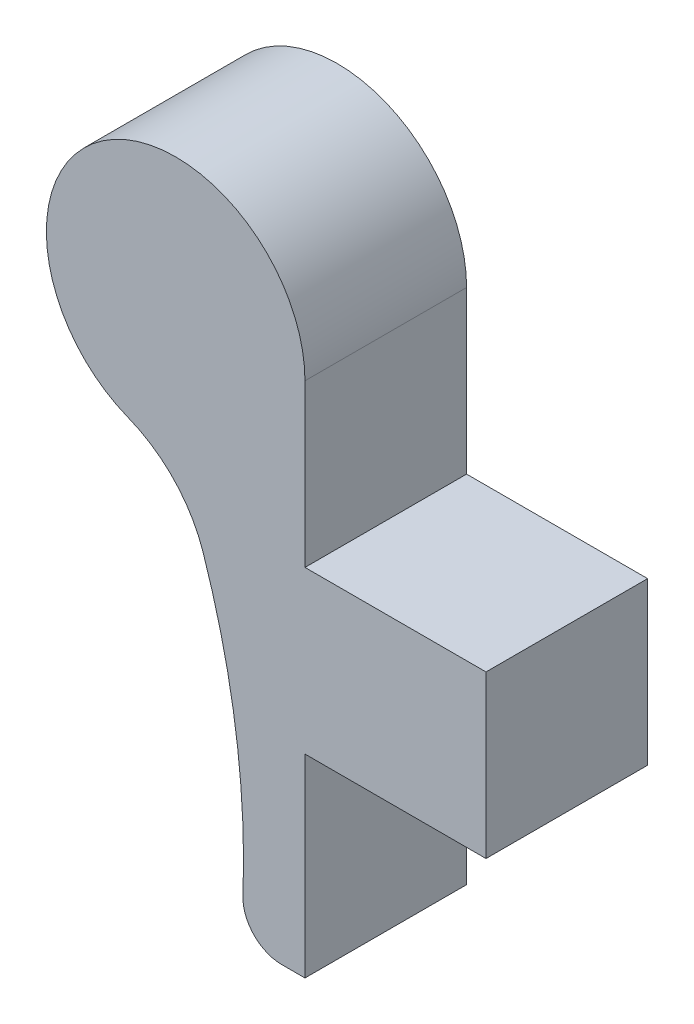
ISO-10303-21;
HEADER;
FILE_DESCRIPTION(('STEP AP214'),'2;1');
FILE_NAME('part.step','',(''),(''),'','','');
FILE_SCHEMA(('AUTOMOTIVE_DESIGN { 1 0 10303 214 1 1 1 1 }'));
ENDSEC;
DATA;
#1=APPLICATION_CONTEXT('core data for automotive mechanical design processes');
#2=APPLICATION_PROTOCOL_DEFINITION('international standard','automotive_design',2000,#1);
#3=PRODUCT_CONTEXT('',#1,'mechanical');
#4=PRODUCT('Part','Part','',(#3));
#5=PRODUCT_RELATED_PRODUCT_CATEGORY('part','',(#4));
#6=PRODUCT_DEFINITION_FORMATION('','',#4);
#7=PRODUCT_DEFINITION_CONTEXT('part definition',#1,'design');
#8=PRODUCT_DEFINITION('design','',#6,#7);
#9=PRODUCT_DEFINITION_SHAPE('','',#8);
#10=(LENGTH_UNIT() NAMED_UNIT(*) SI_UNIT(.MILLI.,.METRE.));
#11=(NAMED_UNIT(*) PLANE_ANGLE_UNIT() SI_UNIT($,.RADIAN.));
#12=(NAMED_UNIT(*) SI_UNIT($,.STERADIAN.) SOLID_ANGLE_UNIT());
#13=UNCERTAINTY_MEASURE_WITH_UNIT(LENGTH_MEASURE(1.E-05),#10,'distance_accuracy_value','');
#14=(GEOMETRIC_REPRESENTATION_CONTEXT(3) GLOBAL_UNCERTAINTY_ASSIGNED_CONTEXT((#13)) GLOBAL_UNIT_ASSIGNED_CONTEXT((#10,
#11,#12)) REPRESENTATION_CONTEXT('',''));
#15=CARTESIAN_POINT('',(0.,0.,0.));
#16=DIRECTION('',(0.,0.,1.));
#17=DIRECTION('',(1.,0.,0.));
#18=AXIS2_PLACEMENT_3D('',#15,#16,#17);
#19=CARTESIAN_POINT('',(2.54,0.,3.175));
#20=DIRECTION('',(1.,0.,0.));
#21=DIRECTION('',(0.,1.,0.));
#22=AXIS2_PLACEMENT_3D('',#19,#20,#21);
#23=PLANE('',#22);
#24=DIRECTION('',(0.,-1.,0.));
#25=VECTOR('',#24,1.);
#26=CARTESIAN_POINT('',(2.54,0.,0.));
#27=LINE('',#26,#25);
#28=CARTESIAN_POINT('',(2.54,-6.35,0.));
#29=VERTEX_POINT('',#28);
#30=CARTESIAN_POINT('',(2.54,-10.16,0.));
#31=VERTEX_POINT('',#30);
#32=EDGE_CURVE('E162',#29,#31,#27,.T.);
#33=ORIENTED_EDGE('',*,*,#32,.F.);
#34=DIRECTION('',(0.,0.,-1.));
#35=VECTOR('',#34,1.);
#36=CARTESIAN_POINT('',(2.54,-6.35,3.175));
#37=LINE('',#36,#35);
#38=CARTESIAN_POINT('',(2.54,-6.35,3.175));
#39=VERTEX_POINT('',#38);
#40=EDGE_CURVE('E221',#39,#29,#37,.T.);
#41=ORIENTED_EDGE('',*,*,#40,.F.);
#42=DIRECTION('',(0.,-1.,0.));
#43=VECTOR('',#42,1.);
#44=CARTESIAN_POINT('',(2.54,0.,3.175));
#45=LINE('',#44,#43);
#46=CARTESIAN_POINT('',(2.54,-10.16,3.175));
#47=VERTEX_POINT('',#46);
#48=EDGE_CURVE('E136',#39,#47,#45,.T.);
#49=ORIENTED_EDGE('',*,*,#48,.T.);
#50=DIRECTION('',(0.,0.,-1.));
#51=VECTOR('',#50,1.);
#52=CARTESIAN_POINT('',(2.54,-10.16,3.175));
#53=LINE('',#52,#51);
#54=EDGE_CURVE('E166',#47,#31,#53,.T.);
#55=ORIENTED_EDGE('',*,*,#54,.T.);
#56=EDGE_LOOP('',(#33,#41,#49,#55));
#57=FACE_BOUND('',#56,.T.);
#58=ADVANCED_FACE('F35',(#57),#23,.T.);
#59=CARTESIAN_POINT('',(0.,0.,3.175));
#60=DIRECTION('',(0.,0.,-1.));
#61=DIRECTION('',(-1.,0.,0.));
#62=AXIS2_PLACEMENT_3D('',#59,#60,#61);
#63=CYLINDRICAL_SURFACE('',#62,2.54);
#64=CARTESIAN_POINT('',(0.,0.,0.));
#65=DIRECTION('',(0.,0.,1.));
#66=DIRECTION('',(1.,0.,0.));
#67=AXIS2_PLACEMENT_3D('',#64,#65,#66);
#68=CIRCLE('',#67,2.54);
#69=CARTESIAN_POINT('',(2.54,0.,0.));
#70=VERTEX_POINT('',#69);
#71=CARTESIAN_POINT('',(-0.935002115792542,-2.36164583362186,0.));
#72=VERTEX_POINT('',#71);
#73=EDGE_CURVE('E137',#70,#72,#68,.T.);
#74=ORIENTED_EDGE('',*,*,#73,.T.);
#75=DIRECTION('',(0.,0.,-1.));
#76=VECTOR('',#75,1.);
#77=CARTESIAN_POINT('',(-0.935002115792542,-2.36164583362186,3.175));
#78=LINE('',#77,#76);
#79=CARTESIAN_POINT('',(-0.935002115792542,-2.36164583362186,3.175));
#80=VERTEX_POINT('',#79);
#81=EDGE_CURVE('E172',#72,#80,#78,.F.);
#82=ORIENTED_EDGE('',*,*,#81,.T.);
#83=CARTESIAN_POINT('',(0.,0.,3.175));
#84=DIRECTION('',(0.,0.,1.));
#85=DIRECTION('',(1.,0.,0.));
#86=AXIS2_PLACEMENT_3D('',#83,#84,#85);
#87=CIRCLE('',#86,2.54);
#88=CARTESIAN_POINT('',(2.54,0.,3.175));
#89=VERTEX_POINT('',#88);
#90=EDGE_CURVE('E146',#89,#80,#87,.T.);
#91=ORIENTED_EDGE('',*,*,#90,.F.);
#92=DIRECTION('',(0.,0.,-1.));
#93=VECTOR('',#92,1.);
#94=CARTESIAN_POINT('',(2.54,0.,3.175));
#95=LINE('',#94,#93);
#96=EDGE_CURVE('E157',#89,#70,#95,.T.);
#97=ORIENTED_EDGE('',*,*,#96,.T.);
#98=EDGE_LOOP('',(#74,#82,#91,#97));
#99=FACE_BOUND('',#98,.T.);
#100=ADVANCED_FACE('F198',(#99),#63,.T.);
#101=CARTESIAN_POINT('',(-13.9068110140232,-8.77363516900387,3.175));
#102=DIRECTION('',(0.,0.,-1.));
#103=DIRECTION('',(-1.,0.,0.));
#104=AXIS2_PLACEMENT_3D('',#101,#102,#103);
#105=CYLINDRICAL_SURFACE('',#104,15.24);
#106=CARTESIAN_POINT('',(-13.9068110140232,-8.77363516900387,0.));
#107=DIRECTION('',(0.,0.,1.));
#108=DIRECTION('',(1.,0.,0.));
#109=AXIS2_PLACEMENT_3D('',#106,#107,#108);
#110=CIRCLE('',#109,15.24);
#111=CARTESIAN_POINT('',(0.537357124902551,-3.91322296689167,0.));
#112=VERTEX_POINT('',#111);
#113=CARTESIAN_POINT('',(1.32158389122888,-9.36826834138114,0.));
#114=VERTEX_POINT('',#113);
#115=EDGE_CURVE('E140',#112,#114,#110,.F.);
#116=ORIENTED_EDGE('',*,*,#115,.T.);
#117=DIRECTION('',(0.,0.,-1.));
#118=VECTOR('',#117,1.);
#119=CARTESIAN_POINT('',(1.32158389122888,-9.36826834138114,3.175));
#120=LINE('',#119,#118);
#121=CARTESIAN_POINT('',(1.32158389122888,-9.36826834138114,3.175));
#122=VERTEX_POINT('',#121);
#123=EDGE_CURVE('E43',#114,#122,#120,.F.);
#124=ORIENTED_EDGE('',*,*,#123,.T.);
#125=CARTESIAN_POINT('',(-13.9068110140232,-8.77363516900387,3.175));
#126=DIRECTION('',(0.,0.,1.));
#127=DIRECTION('',(1.,0.,0.));
#128=AXIS2_PLACEMENT_3D('',#125,#126,#127);
#129=CIRCLE('',#128,15.24);
#130=CARTESIAN_POINT('',(0.537357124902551,-3.91322296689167,3.175));
#131=VERTEX_POINT('',#130);
#132=EDGE_CURVE('E149',#131,#122,#129,.F.);
#133=ORIENTED_EDGE('',*,*,#132,.F.);
#134=DIRECTION('',(0.,0.,-1.));
#135=VECTOR('',#134,1.);
#136=CARTESIAN_POINT('',(0.537357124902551,-3.91322296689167,3.175));
#137=LINE('',#136,#135);
#138=EDGE_CURVE('E169',#131,#112,#137,.T.);
#139=ORIENTED_EDGE('',*,*,#138,.T.);
#140=EDGE_LOOP('',(#116,#124,#133,#139));
#141=FACE_BOUND('',#140,.T.);
#142=ADVANCED_FACE('F204',(#141),#105,.F.);
#143=CARTESIAN_POINT('',(0.,-10.16,3.175));
#144=DIRECTION('',(0.,-1.,0.));
#145=DIRECTION('',(1.,0.,0.));
#146=AXIS2_PLACEMENT_3D('',#143,#144,#145);
#147=PLANE('',#146);
#148=DIRECTION('',(-1.,0.,0.));
#149=VECTOR('',#148,1.);
#150=CARTESIAN_POINT('',(0.,-10.16,3.175));
#151=LINE('',#150,#149);
#152=CARTESIAN_POINT('',(2.08300363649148,-10.16,3.175));
#153=VERTEX_POINT('',#152);
#154=EDGE_CURVE('E152',#47,#153,#151,.T.);
#155=ORIENTED_EDGE('',*,*,#154,.T.);
#156=DIRECTION('',(0.,0.,1.));
#157=VECTOR('',#156,1.);
#158=CARTESIAN_POINT('',(2.08300363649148,-10.16,0.));
#159=LINE('',#158,#157);
#160=CARTESIAN_POINT('',(2.08300363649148,-10.16,0.));
#161=VERTEX_POINT('',#160);
#162=EDGE_CURVE('E178',#153,#161,#159,.F.);
#163=ORIENTED_EDGE('',*,*,#162,.T.);
#164=DIRECTION('',(-1.,0.,0.));
#165=VECTOR('',#164,1.);
#166=CARTESIAN_POINT('',(0.,-10.16,0.));
#167=LINE('',#166,#165);
#168=EDGE_CURVE('E160',#31,#161,#167,.T.);
#169=ORIENTED_EDGE('',*,*,#168,.F.);
#170=ORIENTED_EDGE('',*,*,#54,.F.);
#171=EDGE_LOOP('',(#155,#163,#169,#170));
#172=FACE_BOUND('',#171,.T.);
#173=ADVANCED_FACE('F184',(#172),#147,.T.);
#174=DIRECTION('',(0.,0.,-1.));
#175=VECTOR('',#174,1.);
#176=CARTESIAN_POINT('',(2.54,-3.175,3.175));
#177=LINE('',#176,#175);
#178=CARTESIAN_POINT('',(2.54,-3.175,3.175));
#179=VERTEX_POINT('',#178);
#180=CARTESIAN_POINT('',(2.54,-3.175,0.));
#181=VERTEX_POINT('',#180);
#182=EDGE_CURVE('E131',#179,#181,#177,.T.);
#183=ORIENTED_EDGE('',*,*,#182,.T.);
#184=EDGE_CURVE('E150',#70,#181,#27,.T.);
#185=ORIENTED_EDGE('',*,*,#184,.F.);
#186=ORIENTED_EDGE('',*,*,#96,.F.);
#187=EDGE_CURVE('E155',#89,#179,#45,.T.);
#188=ORIENTED_EDGE('',*,*,#187,.T.);
#189=EDGE_LOOP('',(#183,#185,#186,#188));
#190=FACE_BOUND('',#189,.T.);
#191=ADVANCED_FACE('F200',(#190),#23,.T.);
#192=CARTESIAN_POINT('',(0.,0.,3.175));
#193=DIRECTION('',(0.,0.,1.));
#194=DIRECTION('',(1.,0.,0.));
#195=AXIS2_PLACEMENT_3D('',#192,#193,#194);
#196=PLANE('',#195);
#197=ORIENTED_EDGE('',*,*,#132,.T.);
#198=CARTESIAN_POINT('',(2.08300363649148,-9.398,3.175));
#199=DIRECTION('',(0.,0.,1.));
#200=DIRECTION('',(1.,0.,0.));
#201=AXIS2_PLACEMENT_3D('',#198,#199,#200);
#202=CIRCLE('',#201,0.762);
#203=EDGE_CURVE('E11',#122,#153,#202,.T.);
#204=ORIENTED_EDGE('',*,*,#203,.T.);
#205=ORIENTED_EDGE('',*,*,#154,.F.);
#206=ORIENTED_EDGE('',*,*,#48,.F.);
#207=DIRECTION('',(-1.,0.,0.));
#208=VECTOR('',#207,1.);
#209=CARTESIAN_POINT('',(6.096,-6.35,3.175));
#210=LINE('',#209,#208);
#211=CARTESIAN_POINT('',(6.096,-6.35,3.175));
#212=VERTEX_POINT('',#211);
#213=EDGE_CURVE('E115',#212,#39,#210,.T.);
#214=ORIENTED_EDGE('',*,*,#213,.F.);
#215=DIRECTION('',(0.,-1.,0.));
#216=VECTOR('',#215,1.);
#217=CARTESIAN_POINT('',(6.096,-3.175,3.175));
#218=LINE('',#217,#216);
#219=CARTESIAN_POINT('',(6.096,-3.175,3.175));
#220=VERTEX_POINT('',#219);
#221=EDGE_CURVE('E123',#220,#212,#218,.T.);
#222=ORIENTED_EDGE('',*,*,#221,.F.);
#223=DIRECTION('',(-1.,0.,0.));
#224=VECTOR('',#223,1.);
#225=CARTESIAN_POINT('',(6.096,-3.175,3.175));
#226=LINE('',#225,#224);
#227=EDGE_CURVE('E316',#220,#179,#226,.T.);
#228=ORIENTED_EDGE('',*,*,#227,.T.);
#229=ORIENTED_EDGE('',*,*,#187,.F.);
#230=ORIENTED_EDGE('',*,*,#90,.T.);
#231=CARTESIAN_POINT('',(-1.87000423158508,-4.72329166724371,3.175));
#232=DIRECTION('',(0.,0.,1.));
#233=DIRECTION('',(1.,0.,0.));
#234=AXIS2_PLACEMENT_3D('',#231,#232,#233);
#235=CIRCLE('',#234,2.54);
#236=EDGE_CURVE('E176',#80,#131,#235,.F.);
#237=ORIENTED_EDGE('',*,*,#236,.T.);
#238=EDGE_LOOP('',(#197,#204,#205,#206,#214,#222,#228,#229,#230,#237));
#239=FACE_BOUND('',#238,.T.);
#240=ADVANCED_FACE('F134',(#239),#196,.T.);
#241=CARTESIAN_POINT('',(0.,0.,0.));
#242=DIRECTION('',(0.,0.,1.));
#243=DIRECTION('',(1.,0.,0.));
#244=AXIS2_PLACEMENT_3D('',#241,#242,#243);
#245=PLANE('',#244);
#246=ORIENTED_EDGE('',*,*,#168,.T.);
#247=CARTESIAN_POINT('',(2.08300363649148,-9.398,0.));
#248=DIRECTION('',(0.,0.,1.));
#249=DIRECTION('',(1.,0.,0.));
#250=AXIS2_PLACEMENT_3D('',#247,#248,#249);
#251=CIRCLE('',#250,0.762);
#252=EDGE_CURVE('E57',#161,#114,#251,.F.);
#253=ORIENTED_EDGE('',*,*,#252,.T.);
#254=ORIENTED_EDGE('',*,*,#115,.F.);
#255=CARTESIAN_POINT('',(-1.87000423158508,-4.72329166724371,0.));
#256=DIRECTION('',(0.,0.,1.));
#257=DIRECTION('',(1.,0.,0.));
#258=AXIS2_PLACEMENT_3D('',#255,#256,#257);
#259=CIRCLE('',#258,2.54);
#260=EDGE_CURVE('E174',#112,#72,#259,.T.);
#261=ORIENTED_EDGE('',*,*,#260,.T.);
#262=ORIENTED_EDGE('',*,*,#73,.F.);
#263=ORIENTED_EDGE('',*,*,#184,.T.);
#264=DIRECTION('',(-1.,0.,0.));
#265=VECTOR('',#264,1.);
#266=CARTESIAN_POINT('',(6.096,-3.175,0.));
#267=LINE('',#266,#265);
#268=CARTESIAN_POINT('',(6.096,-3.175,0.));
#269=VERTEX_POINT('',#268);
#270=EDGE_CURVE('E142',#269,#181,#267,.T.);
#271=ORIENTED_EDGE('',*,*,#270,.F.);
#272=DIRECTION('',(0.,-1.,0.));
#273=VECTOR('',#272,1.);
#274=CARTESIAN_POINT('',(6.096,-3.175,0.));
#275=LINE('',#274,#273);
#276=CARTESIAN_POINT('',(6.096,-6.35,0.));
#277=VERTEX_POINT('',#276);
#278=EDGE_CURVE('E122',#269,#277,#275,.T.);
#279=ORIENTED_EDGE('',*,*,#278,.T.);
#280=DIRECTION('',(-1.,0.,0.));
#281=VECTOR('',#280,1.);
#282=CARTESIAN_POINT('',(6.096,-6.35,0.));
#283=LINE('',#282,#281);
#284=EDGE_CURVE('E118',#277,#29,#283,.T.);
#285=ORIENTED_EDGE('',*,*,#284,.T.);
#286=ORIENTED_EDGE('',*,*,#32,.T.);
#287=EDGE_LOOP('',(#246,#253,#254,#261,#262,#263,#271,#279,#285,#286));
#288=FACE_BOUND('',#287,.T.);
#289=ADVANCED_FACE('F188',(#288),#245,.F.);
#290=CARTESIAN_POINT('',(-1.87000423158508,-4.72329166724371,3.175));
#291=DIRECTION('',(0.,0.,-1.));
#292=DIRECTION('',(-1.,0.,0.));
#293=AXIS2_PLACEMENT_3D('',#290,#291,#292);
#294=CYLINDRICAL_SURFACE('',#293,2.54);
#295=ORIENTED_EDGE('',*,*,#236,.F.);
#296=ORIENTED_EDGE('',*,*,#81,.F.);
#297=ORIENTED_EDGE('',*,*,#260,.F.);
#298=ORIENTED_EDGE('',*,*,#138,.F.);
#299=EDGE_LOOP('',(#295,#296,#297,#298));
#300=FACE_BOUND('',#299,.T.);
#301=ADVANCED_FACE('F228',(#300),#294,.F.);
#302=CARTESIAN_POINT('',(6.096,-6.35,3.175));
#303=DIRECTION('',(0.,1.,0.));
#304=DIRECTION('',(-1.,0.,0.));
#305=AXIS2_PLACEMENT_3D('',#302,#303,#304);
#306=PLANE('',#305);
#307=ORIENTED_EDGE('',*,*,#40,.T.);
#308=ORIENTED_EDGE('',*,*,#284,.F.);
#309=DIRECTION('',(0.,0.,-1.));
#310=VECTOR('',#309,1.);
#311=CARTESIAN_POINT('',(6.096,-6.35,3.175));
#312=LINE('',#311,#310);
#313=EDGE_CURVE('E111',#212,#277,#312,.T.);
#314=ORIENTED_EDGE('',*,*,#313,.F.);
#315=ORIENTED_EDGE('',*,*,#213,.T.);
#316=EDGE_LOOP('',(#307,#308,#314,#315));
#317=FACE_BOUND('',#316,.T.);
#318=ADVANCED_FACE('F113',(#317),#306,.F.);
#319=CARTESIAN_POINT('',(6.096,-3.175,3.175));
#320=DIRECTION('',(0.,1.,0.));
#321=DIRECTION('',(-1.,0.,0.));
#322=AXIS2_PLACEMENT_3D('',#319,#320,#321);
#323=PLANE('',#322);
#324=ORIENTED_EDGE('',*,*,#182,.F.);
#325=ORIENTED_EDGE('',*,*,#227,.F.);
#326=DIRECTION('',(0.,0.,-1.));
#327=VECTOR('',#326,1.);
#328=CARTESIAN_POINT('',(6.096,-3.175,3.175));
#329=LINE('',#328,#327);
#330=EDGE_CURVE('E129',#220,#269,#329,.T.);
#331=ORIENTED_EDGE('',*,*,#330,.T.);
#332=ORIENTED_EDGE('',*,*,#270,.T.);
#333=EDGE_LOOP('',(#324,#325,#331,#332));
#334=FACE_BOUND('',#333,.T.);
#335=ADVANCED_FACE('F195',(#334),#323,.T.);
#336=CARTESIAN_POINT('',(6.096,0.,0.));
#337=DIRECTION('',(1.,0.,0.));
#338=DIRECTION('',(0.,1.,0.));
#339=AXIS2_PLACEMENT_3D('',#336,#337,#338);
#340=PLANE('',#339);
#341=ORIENTED_EDGE('',*,*,#221,.T.);
#342=ORIENTED_EDGE('',*,*,#313,.T.);
#343=ORIENTED_EDGE('',*,*,#278,.F.);
#344=ORIENTED_EDGE('',*,*,#330,.F.);
#345=EDGE_LOOP('',(#341,#342,#343,#344));
#346=FACE_BOUND('',#345,.T.);
#347=ADVANCED_FACE('F127',(#346),#340,.T.);
#348=CARTESIAN_POINT('',(2.08300363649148,-9.398,3.175));
#349=DIRECTION('',(0.,0.,-1.));
#350=DIRECTION('',(-1.,0.,0.));
#351=AXIS2_PLACEMENT_3D('',#348,#349,#350);
#352=CYLINDRICAL_SURFACE('',#351,0.762);
#353=ORIENTED_EDGE('',*,*,#203,.F.);
#354=ORIENTED_EDGE('',*,*,#123,.F.);
#355=ORIENTED_EDGE('',*,*,#252,.F.);
#356=ORIENTED_EDGE('',*,*,#162,.F.);
#357=EDGE_LOOP('',(#353,#354,#355,#356));
#358=FACE_BOUND('',#357,.T.);
#359=ADVANCED_FACE('F37',(#358),#352,.T.);
#360=CLOSED_SHELL('',(#58,#100,#142,#173,#191,#240,#289,#301,#318,#335,#347,#359));
#361=MANIFOLD_SOLID_BREP('B2',#360);
#362=ADVANCED_BREP_SHAPE_REPRESENTATION('',(#18,#361),#14);
#363=SHAPE_DEFINITION_REPRESENTATION(#9,#362);
ENDSEC;
END-ISO-10303-21;
